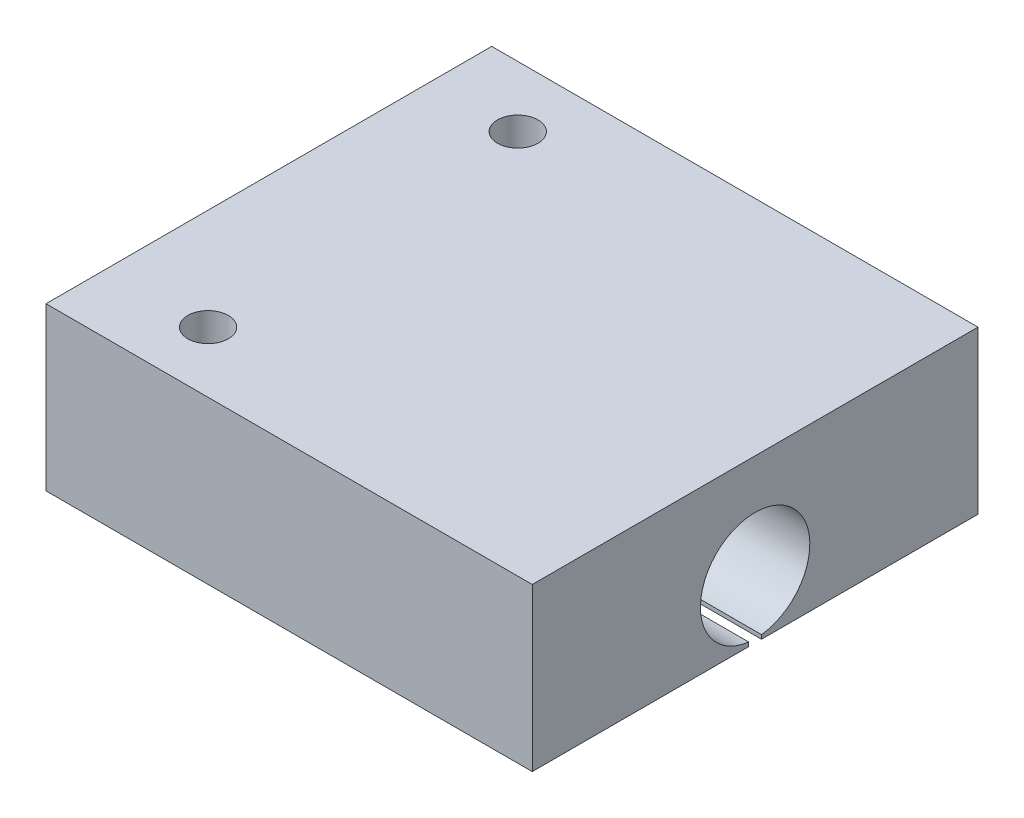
from build123d import *

# Parameters (mm, degrees)
SKETCH1_W           = 76.2
SKETCH1_H           = 69.85
SKETCH1_R           = 3.175
BOSS_EXTRUDE1_DEPTH = 25.4
SKETCH2_R           = 8.5725
CUT_EXTRUDE3_DEPTH  = 76.2
SKETCH3_W           = 76.2
SKETCH3_H           = 2.000000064
CUT_EXTRUDE4_DEPTH  = 2.54


with BuildPart() as part:
    # Sketch1 → Boss-Extrude1 (new body)
    with BuildSketch(Plane(origin=(0, 0, 0), x_dir=(1, 0, 0), z_dir=(0, 1, 0))):
        with Locations((38.1, 34.925)):
            Rectangle(SKETCH1_W, SKETCH1_H)
        with Locations(Location((15.875, 9.525, 0), (0, 0, 270))):
            Circle(SKETCH1_R, mode=Mode.SUBTRACT)
        with Locations(Location((13.599021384, 60.325, 0), (0, 0, 270))):
            Circle(SKETCH1_R, mode=Mode.SUBTRACT)
    extrude(amount=BOSS_EXTRUDE1_DEPTH)

    # Sketch2 → Cut-Extrude3 (cut)
    with BuildSketch(Plane.ZY):
        with Locations((-34.925, 9.144)):
            Circle(SKETCH2_R)
    extrude(amount=-CUT_EXTRUDE3_DEPTH, mode=Mode.SUBTRACT)

    # Sketch3 → Cut-Extrude4 (cut)
    with BuildSketch(Plane.XZ):
        with Locations((38.1, -34.925)):
            Rectangle(SKETCH3_W, SKETCH3_H)
    extrude(amount=-CUT_EXTRUDE4_DEPTH, mode=Mode.SUBTRACT)


solid = part.part
